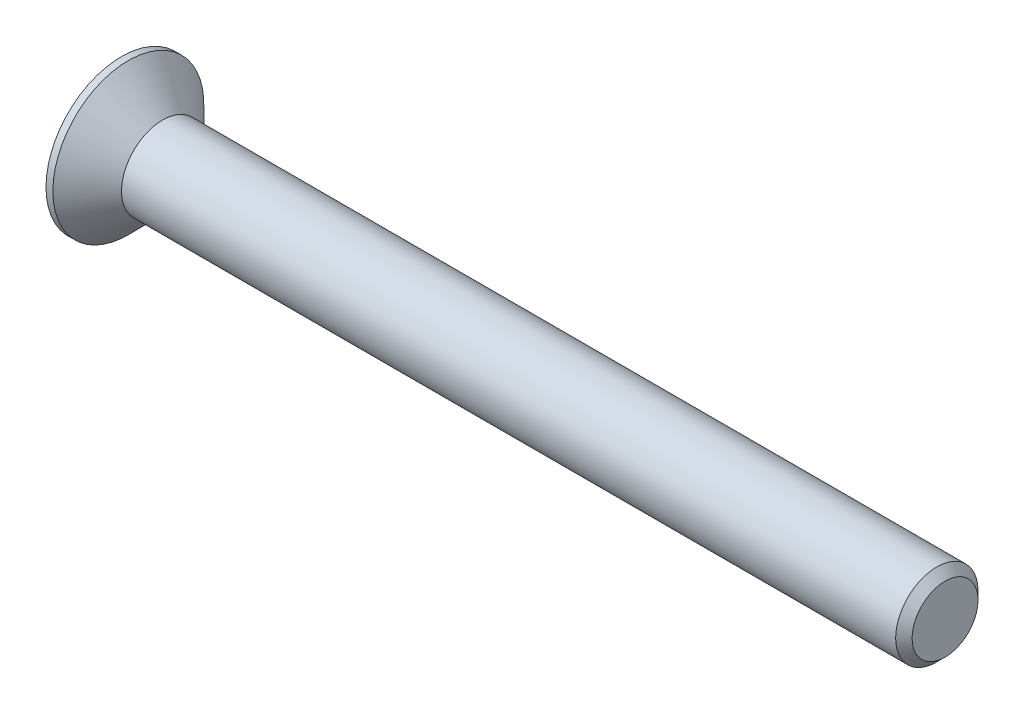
ISO-10303-21;
HEADER;
FILE_DESCRIPTION(('STEP AP214'),'2;1');
FILE_NAME('part.step','',(''),(''),'','','');
FILE_SCHEMA(('AUTOMOTIVE_DESIGN { 1 0 10303 214 1 1 1 1 }'));
ENDSEC;
DATA;
#1=APPLICATION_CONTEXT('core data for automotive mechanical design processes');
#2=APPLICATION_PROTOCOL_DEFINITION('international standard','automotive_design',2000,#1);
#3=PRODUCT_CONTEXT('',#1,'mechanical');
#4=PRODUCT('Part','Part','',(#3));
#5=PRODUCT_RELATED_PRODUCT_CATEGORY('part','',(#4));
#6=PRODUCT_DEFINITION_FORMATION('','',#4);
#7=PRODUCT_DEFINITION_CONTEXT('part definition',#1,'design');
#8=PRODUCT_DEFINITION('design','',#6,#7);
#9=PRODUCT_DEFINITION_SHAPE('','',#8);
#10=(LENGTH_UNIT() NAMED_UNIT(*) SI_UNIT(.MILLI.,.METRE.));
#11=(NAMED_UNIT(*) PLANE_ANGLE_UNIT() SI_UNIT($,.RADIAN.));
#12=(NAMED_UNIT(*) SI_UNIT($,.STERADIAN.) SOLID_ANGLE_UNIT());
#13=UNCERTAINTY_MEASURE_WITH_UNIT(LENGTH_MEASURE(1.E-05),#10,'distance_accuracy_value','');
#14=(GEOMETRIC_REPRESENTATION_CONTEXT(3) GLOBAL_UNCERTAINTY_ASSIGNED_CONTEXT((#13)) GLOBAL_UNIT_ASSIGNED_CONTEXT((#10,
#11,#12)) REPRESENTATION_CONTEXT('',''));
#15=CARTESIAN_POINT('',(0.,0.,0.));
#16=DIRECTION('',(0.,0.,1.));
#17=DIRECTION('',(1.,0.,0.));
#18=AXIS2_PLACEMENT_3D('',#15,#16,#17);
#19=CARTESIAN_POINT('',(0.,0.,0.));
#20=DIRECTION('',(-1.,0.,0.));
#21=DIRECTION('',(0.,0.,1.));
#22=AXIS2_PLACEMENT_3D('',#19,#20,#21);
#23=CONICAL_SURFACE('',#22,3.,0.78539816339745);
#24=CARTESIAN_POINT('',(-2.49999999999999,0.,0.));
#25=DIRECTION('',(-1.,0.,0.));
#26=DIRECTION('',(0.,0.,1.));
#27=AXIS2_PLACEMENT_3D('',#24,#25,#26);
#28=CIRCLE('',#27,5.5);
#29=CARTESIAN_POINT('',(-2.49999999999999,0.,5.5));
#30=VERTEX_POINT('',#29);
#31=EDGE_CURVE('E189',#30,#30,#28,.T.);
#32=ORIENTED_EDGE('',*,*,#31,.F.);
#33=EDGE_LOOP('',(#32));
#34=FACE_BOUND('',#33,.T.);
#35=CARTESIAN_POINT('',(0.,0.,0.));
#36=DIRECTION('',(-1.,0.,0.));
#37=DIRECTION('',(0.,0.,1.));
#38=AXIS2_PLACEMENT_3D('',#35,#36,#37);
#39=CIRCLE('',#38,3.);
#40=CARTESIAN_POINT('',(0.,0.,3.));
#41=VERTEX_POINT('',#40);
#42=EDGE_CURVE('E212',#41,#41,#39,.T.);
#43=ORIENTED_EDGE('',*,*,#42,.T.);
#44=EDGE_LOOP('',(#43));
#45=FACE_BOUND('',#44,.T.);
#46=ADVANCED_FACE('F33',(#34,#45),#23,.T.);
#47=CARTESIAN_POINT('',(-3.,0.,0.));
#48=DIRECTION('',(-1.,0.,0.));
#49=DIRECTION('',(0.,0.,1.));
#50=AXIS2_PLACEMENT_3D('',#47,#48,#49);
#51=CYLINDRICAL_SURFACE('',#50,3.);
#52=CARTESIAN_POINT('',(56.4,0.,0.));
#53=DIRECTION('',(-1.,0.,0.));
#54=DIRECTION('',(0.,0.,1.));
#55=AXIS2_PLACEMENT_3D('',#52,#53,#54);
#56=CIRCLE('',#55,3.);
#57=CARTESIAN_POINT('',(56.4,0.,3.));
#58=VERTEX_POINT('',#57);
#59=EDGE_CURVE('E41',#58,#58,#56,.T.);
#60=ORIENTED_EDGE('',*,*,#59,.T.);
#61=EDGE_LOOP('',(#60));
#62=FACE_BOUND('',#61,.T.);
#63=ORIENTED_EDGE('',*,*,#42,.F.);
#64=EDGE_LOOP('',(#63));
#65=FACE_BOUND('',#64,.T.);
#66=ADVANCED_FACE('F217',(#62,#65),#51,.T.);
#67=CARTESIAN_POINT('',(57.,0.,0.));
#68=DIRECTION('',(-1.,0.,0.));
#69=DIRECTION('',(0.,0.,1.));
#70=AXIS2_PLACEMENT_3D('',#67,#68,#69);
#71=PLANE('',#70);
#72=CARTESIAN_POINT('',(57.,0.,0.));
#73=DIRECTION('',(-1.,0.,0.));
#74=DIRECTION('',(0.,0.,1.));
#75=AXIS2_PLACEMENT_3D('',#72,#73,#74);
#76=CIRCLE('',#75,2.39999999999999);
#77=CARTESIAN_POINT('',(57.,0.,2.39999999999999));
#78=VERTEX_POINT('',#77);
#79=EDGE_CURVE('E11',#78,#78,#76,.F.);
#80=ORIENTED_EDGE('',*,*,#79,.T.);
#81=EDGE_LOOP('',(#80));
#82=FACE_BOUND('',#81,.T.);
#83=ADVANCED_FACE('F239',(#82),#71,.F.);
#84=CARTESIAN_POINT('',(-3.,5.5,0.));
#85=DIRECTION('',(1.,0.,0.));
#86=DIRECTION('',(0.,0.,-1.));
#87=AXIS2_PLACEMENT_3D('',#84,#85,#86);
#88=PLANE('',#87);
#89=DIRECTION('',(0.,0.,-1.));
#90=VECTOR('',#89,1.);
#91=CARTESIAN_POINT('',(-3.,0.825,-3.3));
#92=LINE('',#91,#90);
#93=CARTESIAN_POINT('',(-3.,0.825,-0.825));
#94=VERTEX_POINT('',#93);
#95=CARTESIAN_POINT('',(-3.,0.825,-3.3));
#96=VERTEX_POINT('',#95);
#97=EDGE_CURVE('E158',#94,#96,#92,.T.);
#98=ORIENTED_EDGE('',*,*,#97,.F.);
#99=DIRECTION('',(0.,-1.,0.));
#100=VECTOR('',#99,1.);
#101=CARTESIAN_POINT('',(-3.,0.825,-0.825));
#102=LINE('',#101,#100);
#103=CARTESIAN_POINT('',(-3.,3.3,-0.825));
#104=VERTEX_POINT('',#103);
#105=EDGE_CURVE('E48',#104,#94,#102,.T.);
#106=ORIENTED_EDGE('',*,*,#105,.F.);
#107=DIRECTION('',(0.,0.,-1.));
#108=VECTOR('',#107,1.);
#109=CARTESIAN_POINT('',(-3.,3.3,-0.825));
#110=LINE('',#109,#108);
#111=CARTESIAN_POINT('',(-3.,3.3,0.825));
#112=VERTEX_POINT('',#111);
#113=EDGE_CURVE('E185',#112,#104,#110,.T.);
#114=ORIENTED_EDGE('',*,*,#113,.F.);
#115=DIRECTION('',(0.,1.,0.));
#116=VECTOR('',#115,1.);
#117=CARTESIAN_POINT('',(-3.,3.3,0.825));
#118=LINE('',#117,#116);
#119=CARTESIAN_POINT('',(-3.,0.825,0.825));
#120=VERTEX_POINT('',#119);
#121=EDGE_CURVE('E183',#120,#112,#118,.T.);
#122=ORIENTED_EDGE('',*,*,#121,.F.);
#123=DIRECTION('',(0.,0.,-1.));
#124=VECTOR('',#123,1.);
#125=CARTESIAN_POINT('',(-3.,0.825,0.825));
#126=LINE('',#125,#124);
#127=CARTESIAN_POINT('',(-3.,0.825,3.3));
#128=VERTEX_POINT('',#127);
#129=EDGE_CURVE('E132',#128,#120,#126,.T.);
#130=ORIENTED_EDGE('',*,*,#129,.F.);
#131=DIRECTION('',(0.,1.,0.));
#132=VECTOR('',#131,1.);
#133=CARTESIAN_POINT('',(-3.,0.825,3.3));
#134=LINE('',#133,#132);
#135=CARTESIAN_POINT('',(-3.,-0.825,3.3));
#136=VERTEX_POINT('',#135);
#137=EDGE_CURVE('E179',#136,#128,#134,.T.);
#138=ORIENTED_EDGE('',*,*,#137,.F.);
#139=DIRECTION('',(0.,0.,1.));
#140=VECTOR('',#139,1.);
#141=CARTESIAN_POINT('',(-3.,-0.825,3.3));
#142=LINE('',#141,#140);
#143=CARTESIAN_POINT('',(-3.,-0.825,0.825));
#144=VERTEX_POINT('',#143);
#145=EDGE_CURVE('E176',#144,#136,#142,.T.);
#146=ORIENTED_EDGE('',*,*,#145,.F.);
#147=DIRECTION('',(0.,1.,0.));
#148=VECTOR('',#147,1.);
#149=CARTESIAN_POINT('',(-3.,-0.825,0.825));
#150=LINE('',#149,#148);
#151=CARTESIAN_POINT('',(-3.,-3.3,0.825));
#152=VERTEX_POINT('',#151);
#153=EDGE_CURVE('E173',#152,#144,#150,.T.);
#154=ORIENTED_EDGE('',*,*,#153,.F.);
#155=DIRECTION('',(0.,0.,1.));
#156=VECTOR('',#155,1.);
#157=CARTESIAN_POINT('',(-3.,-3.3,0.825));
#158=LINE('',#157,#156);
#159=CARTESIAN_POINT('',(-3.,-3.3,-0.825));
#160=VERTEX_POINT('',#159);
#161=EDGE_CURVE('E170',#160,#152,#158,.T.);
#162=ORIENTED_EDGE('',*,*,#161,.F.);
#163=DIRECTION('',(0.,-1.,0.));
#164=VECTOR('',#163,1.);
#165=CARTESIAN_POINT('',(-3.,-3.3,-0.825));
#166=LINE('',#165,#164);
#167=CARTESIAN_POINT('',(-3.,-0.825,-0.825));
#168=VERTEX_POINT('',#167);
#169=EDGE_CURVE('E167',#168,#160,#166,.T.);
#170=ORIENTED_EDGE('',*,*,#169,.F.);
#171=DIRECTION('',(0.,0.,1.));
#172=VECTOR('',#171,1.);
#173=CARTESIAN_POINT('',(-3.,-0.825,-0.825));
#174=LINE('',#173,#172);
#175=CARTESIAN_POINT('',(-3.,-0.825,-3.3));
#176=VERTEX_POINT('',#175);
#177=EDGE_CURVE('E164',#176,#168,#174,.T.);
#178=ORIENTED_EDGE('',*,*,#177,.F.);
#179=DIRECTION('',(0.,-1.,0.));
#180=VECTOR('',#179,1.);
#181=CARTESIAN_POINT('',(-3.,-0.825,-3.3));
#182=LINE('',#181,#180);
#183=EDGE_CURVE('E161',#96,#176,#182,.T.);
#184=ORIENTED_EDGE('',*,*,#183,.F.);
#185=EDGE_LOOP('',(#98,#106,#114,#122,#130,#138,#146,#154,#162,#170,#178,#184));
#186=FACE_BOUND('',#185,.T.);
#187=CARTESIAN_POINT('',(-3.,0.,0.));
#188=DIRECTION('',(-1.,0.,0.));
#189=DIRECTION('',(0.,0.,1.));
#190=AXIS2_PLACEMENT_3D('',#187,#188,#189);
#191=CIRCLE('',#190,5.5);
#192=CARTESIAN_POINT('',(-3.,0.,5.5));
#193=VERTEX_POINT('',#192);
#194=EDGE_CURVE('E209',#193,#193,#191,.T.);
#195=ORIENTED_EDGE('',*,*,#194,.T.);
#196=EDGE_LOOP('',(#195));
#197=FACE_BOUND('',#196,.T.);
#198=ADVANCED_FACE('F230',(#186,#197),#88,.F.);
#199=CARTESIAN_POINT('',(-3.,0.,0.));
#200=DIRECTION('',(-1.,0.,0.));
#201=DIRECTION('',(0.,0.,1.));
#202=AXIS2_PLACEMENT_3D('',#199,#200,#201);
#203=CYLINDRICAL_SURFACE('',#202,5.5);
#204=ORIENTED_EDGE('',*,*,#194,.F.);
#205=EDGE_LOOP('',(#204));
#206=FACE_BOUND('',#205,.T.);
#207=ORIENTED_EDGE('',*,*,#31,.T.);
#208=EDGE_LOOP('',(#207));
#209=FACE_BOUND('',#208,.T.);
#210=ADVANCED_FACE('F222',(#206,#209),#203,.T.);
#211=CARTESIAN_POINT('',(56.4,0.,0.));
#212=DIRECTION('',(-1.,0.,0.));
#213=DIRECTION('',(0.,0.,1.));
#214=AXIS2_PLACEMENT_3D('',#211,#212,#213);
#215=CONICAL_SURFACE('',#214,3.,0.785398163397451);
#216=ORIENTED_EDGE('',*,*,#79,.F.);
#217=EDGE_LOOP('',(#216));
#218=FACE_BOUND('',#217,.T.);
#219=ORIENTED_EDGE('',*,*,#59,.F.);
#220=EDGE_LOOP('',(#219));
#221=FACE_BOUND('',#220,.T.);
#222=ADVANCED_FACE('F35',(#218,#221),#215,.T.);
#223=CARTESIAN_POINT('',(-0.5,0.825,-0.825));
#224=DIRECTION('',(0.,0.,-1.));
#225=DIRECTION('',(-1.,0.,0.));
#226=AXIS2_PLACEMENT_3D('',#223,#224,#225);
#227=PLANE('',#226);
#228=ORIENTED_EDGE('',*,*,#105,.T.);
#229=DIRECTION('',(-1.,0.,0.));
#230=VECTOR('',#229,1.);
#231=CARTESIAN_POINT('',(-0.5,0.825,-0.825));
#232=LINE('',#231,#230);
#233=CARTESIAN_POINT('',(-0.5,0.825,-0.825));
#234=VERTEX_POINT('',#233);
#235=EDGE_CURVE('E96',#234,#94,#232,.T.);
#236=ORIENTED_EDGE('',*,*,#235,.F.);
#237=DIRECTION('',(0.,-1.,0.));
#238=VECTOR('',#237,1.);
#239=CARTESIAN_POINT('',(-0.5,0.825,-0.825));
#240=LINE('',#239,#238);
#241=CARTESIAN_POINT('',(-0.5,3.3,-0.825));
#242=VERTEX_POINT('',#241);
#243=EDGE_CURVE('E187',#242,#234,#240,.T.);
#244=ORIENTED_EDGE('',*,*,#243,.F.);
#245=DIRECTION('',(-1.,0.,0.));
#246=VECTOR('',#245,1.);
#247=CARTESIAN_POINT('',(-0.5,3.3,-0.825));
#248=LINE('',#247,#246);
#249=EDGE_CURVE('E56',#242,#104,#248,.T.);
#250=ORIENTED_EDGE('',*,*,#249,.T.);
#251=EDGE_LOOP('',(#228,#236,#244,#250));
#252=FACE_BOUND('',#251,.T.);
#253=ADVANCED_FACE('F221',(#252),#227,.F.);
#254=CARTESIAN_POINT('',(-0.5,3.3,-0.825));
#255=DIRECTION('',(0.,1.,0.));
#256=DIRECTION('',(-1.,0.,0.));
#257=AXIS2_PLACEMENT_3D('',#254,#255,#256);
#258=PLANE('',#257);
#259=ORIENTED_EDGE('',*,*,#113,.T.);
#260=ORIENTED_EDGE('',*,*,#249,.F.);
#261=DIRECTION('',(0.,0.,-1.));
#262=VECTOR('',#261,1.);
#263=CARTESIAN_POINT('',(-0.5,3.3,-0.825));
#264=LINE('',#263,#262);
#265=CARTESIAN_POINT('',(-0.5,3.3,0.825));
#266=VERTEX_POINT('',#265);
#267=EDGE_CURVE('E144',#266,#242,#264,.T.);
#268=ORIENTED_EDGE('',*,*,#267,.F.);
#269=DIRECTION('',(-1.,0.,0.));
#270=VECTOR('',#269,1.);
#271=CARTESIAN_POINT('',(-0.5,3.3,0.825));
#272=LINE('',#271,#270);
#273=EDGE_CURVE('E136',#266,#112,#272,.T.);
#274=ORIENTED_EDGE('',*,*,#273,.T.);
#275=EDGE_LOOP('',(#259,#260,#268,#274));
#276=FACE_BOUND('',#275,.T.);
#277=ADVANCED_FACE('F228',(#276),#258,.F.);
#278=CARTESIAN_POINT('',(-0.5,3.3,0.825));
#279=DIRECTION('',(0.,0.,1.));
#280=DIRECTION('',(1.,0.,0.));
#281=AXIS2_PLACEMENT_3D('',#278,#279,#280);
#282=PLANE('',#281);
#283=ORIENTED_EDGE('',*,*,#121,.T.);
#284=ORIENTED_EDGE('',*,*,#273,.F.);
#285=DIRECTION('',(0.,1.,0.));
#286=VECTOR('',#285,1.);
#287=CARTESIAN_POINT('',(-0.5,3.3,0.825));
#288=LINE('',#287,#286);
#289=CARTESIAN_POINT('',(-0.5,0.825,0.825));
#290=VERTEX_POINT('',#289);
#291=EDGE_CURVE('E140',#290,#266,#288,.T.);
#292=ORIENTED_EDGE('',*,*,#291,.F.);
#293=DIRECTION('',(-1.,0.,0.));
#294=VECTOR('',#293,1.);
#295=CARTESIAN_POINT('',(-0.5,0.825,0.825));
#296=LINE('',#295,#294);
#297=EDGE_CURVE('E125',#290,#120,#296,.T.);
#298=ORIENTED_EDGE('',*,*,#297,.T.);
#299=EDGE_LOOP('',(#283,#284,#292,#298));
#300=FACE_BOUND('',#299,.T.);
#301=ADVANCED_FACE('F141',(#300),#282,.F.);
#302=CARTESIAN_POINT('',(-0.5,0.825,0.825));
#303=DIRECTION('',(0.,1.,0.));
#304=DIRECTION('',(-1.,0.,0.));
#305=AXIS2_PLACEMENT_3D('',#302,#303,#304);
#306=PLANE('',#305);
#307=ORIENTED_EDGE('',*,*,#129,.T.);
#308=ORIENTED_EDGE('',*,*,#297,.F.);
#309=DIRECTION('',(0.,0.,-1.));
#310=VECTOR('',#309,1.);
#311=CARTESIAN_POINT('',(-0.5,0.825,0.825));
#312=LINE('',#311,#310);
#313=CARTESIAN_POINT('',(-0.5,0.825,3.3));
#314=VERTEX_POINT('',#313);
#315=EDGE_CURVE('E129',#314,#290,#312,.T.);
#316=ORIENTED_EDGE('',*,*,#315,.F.);
#317=DIRECTION('',(-1.,0.,0.));
#318=VECTOR('',#317,1.);
#319=CARTESIAN_POINT('',(-0.5,0.825,3.3));
#320=LINE('',#319,#318);
#321=EDGE_CURVE('E137',#314,#128,#320,.T.);
#322=ORIENTED_EDGE('',*,*,#321,.T.);
#323=EDGE_LOOP('',(#307,#308,#316,#322));
#324=FACE_BOUND('',#323,.T.);
#325=ADVANCED_FACE('F127',(#324),#306,.F.);
#326=CARTESIAN_POINT('',(-0.5,0.825,3.3));
#327=DIRECTION('',(0.,0.,1.));
#328=DIRECTION('',(1.,0.,0.));
#329=AXIS2_PLACEMENT_3D('',#326,#327,#328);
#330=PLANE('',#329);
#331=ORIENTED_EDGE('',*,*,#137,.T.);
#332=ORIENTED_EDGE('',*,*,#321,.F.);
#333=DIRECTION('',(0.,1.,0.));
#334=VECTOR('',#333,1.);
#335=CARTESIAN_POINT('',(-0.5,0.825,3.3));
#336=LINE('',#335,#334);
#337=CARTESIAN_POINT('',(-0.5,-0.825,3.3));
#338=VERTEX_POINT('',#337);
#339=EDGE_CURVE('E150',#338,#314,#336,.T.);
#340=ORIENTED_EDGE('',*,*,#339,.F.);
#341=DIRECTION('',(-1.,0.,0.));
#342=VECTOR('',#341,1.);
#343=CARTESIAN_POINT('',(-0.5,-0.825,3.3));
#344=LINE('',#343,#342);
#345=EDGE_CURVE('E192',#338,#136,#344,.T.);
#346=ORIENTED_EDGE('',*,*,#345,.T.);
#347=EDGE_LOOP('',(#331,#332,#340,#346));
#348=FACE_BOUND('',#347,.T.);
#349=ADVANCED_FACE('F277',(#348),#330,.F.);
#350=CARTESIAN_POINT('',(-0.5,-0.825,3.3));
#351=DIRECTION('',(0.,-1.,0.));
#352=DIRECTION('',(1.,0.,0.));
#353=AXIS2_PLACEMENT_3D('',#350,#351,#352);
#354=PLANE('',#353);
#355=ORIENTED_EDGE('',*,*,#145,.T.);
#356=ORIENTED_EDGE('',*,*,#345,.F.);
#357=DIRECTION('',(0.,0.,1.));
#358=VECTOR('',#357,1.);
#359=CARTESIAN_POINT('',(-0.5,-0.825,3.3));
#360=LINE('',#359,#358);
#361=CARTESIAN_POINT('',(-0.5,-0.825,0.825));
#362=VERTEX_POINT('',#361);
#363=EDGE_CURVE('E152',#362,#338,#360,.T.);
#364=ORIENTED_EDGE('',*,*,#363,.F.);
#365=DIRECTION('',(-1.,0.,0.));
#366=VECTOR('',#365,1.);
#367=CARTESIAN_POINT('',(-0.5,-0.825,0.825));
#368=LINE('',#367,#366);
#369=EDGE_CURVE('E194',#362,#144,#368,.T.);
#370=ORIENTED_EDGE('',*,*,#369,.T.);
#371=EDGE_LOOP('',(#355,#356,#364,#370));
#372=FACE_BOUND('',#371,.T.);
#373=ADVANCED_FACE('F273',(#372),#354,.F.);
#374=CARTESIAN_POINT('',(-0.5,-0.825,0.825));
#375=DIRECTION('',(0.,0.,1.));
#376=DIRECTION('',(1.,0.,0.));
#377=AXIS2_PLACEMENT_3D('',#374,#375,#376);
#378=PLANE('',#377);
#379=ORIENTED_EDGE('',*,*,#153,.T.);
#380=ORIENTED_EDGE('',*,*,#369,.F.);
#381=DIRECTION('',(0.,1.,0.));
#382=VECTOR('',#381,1.);
#383=CARTESIAN_POINT('',(-0.5,-0.825,0.825));
#384=LINE('',#383,#382);
#385=CARTESIAN_POINT('',(-0.5,-3.3,0.825));
#386=VERTEX_POINT('',#385);
#387=EDGE_CURVE('E422',#386,#362,#384,.T.);
#388=ORIENTED_EDGE('',*,*,#387,.F.);
#389=DIRECTION('',(-1.,0.,0.));
#390=VECTOR('',#389,1.);
#391=CARTESIAN_POINT('',(-0.5,-3.3,0.825));
#392=LINE('',#391,#390);
#393=EDGE_CURVE('E196',#386,#152,#392,.T.);
#394=ORIENTED_EDGE('',*,*,#393,.T.);
#395=EDGE_LOOP('',(#379,#380,#388,#394));
#396=FACE_BOUND('',#395,.T.);
#397=ADVANCED_FACE('F269',(#396),#378,.F.);
#398=CARTESIAN_POINT('',(-0.5,-3.3,0.825));
#399=DIRECTION('',(0.,-1.,0.));
#400=DIRECTION('',(1.,0.,0.));
#401=AXIS2_PLACEMENT_3D('',#398,#399,#400);
#402=PLANE('',#401);
#403=ORIENTED_EDGE('',*,*,#161,.T.);
#404=ORIENTED_EDGE('',*,*,#393,.F.);
#405=DIRECTION('',(0.,0.,1.));
#406=VECTOR('',#405,1.);
#407=CARTESIAN_POINT('',(-0.5,-3.3,0.825));
#408=LINE('',#407,#406);
#409=CARTESIAN_POINT('',(-0.5,-3.3,-0.825));
#410=VERTEX_POINT('',#409);
#411=EDGE_CURVE('E419',#410,#386,#408,.T.);
#412=ORIENTED_EDGE('',*,*,#411,.F.);
#413=DIRECTION('',(-1.,0.,0.));
#414=VECTOR('',#413,1.);
#415=CARTESIAN_POINT('',(-0.5,-3.3,-0.825));
#416=LINE('',#415,#414);
#417=EDGE_CURVE('E198',#410,#160,#416,.T.);
#418=ORIENTED_EDGE('',*,*,#417,.T.);
#419=EDGE_LOOP('',(#403,#404,#412,#418));
#420=FACE_BOUND('',#419,.T.);
#421=ADVANCED_FACE('F265',(#420),#402,.F.);
#422=CARTESIAN_POINT('',(-0.5,-3.3,-0.825));
#423=DIRECTION('',(0.,0.,-1.));
#424=DIRECTION('',(-1.,0.,0.));
#425=AXIS2_PLACEMENT_3D('',#422,#423,#424);
#426=PLANE('',#425);
#427=ORIENTED_EDGE('',*,*,#169,.T.);
#428=ORIENTED_EDGE('',*,*,#417,.F.);
#429=DIRECTION('',(0.,-1.,0.));
#430=VECTOR('',#429,1.);
#431=CARTESIAN_POINT('',(-0.5,-3.3,-0.825));
#432=LINE('',#431,#430);
#433=CARTESIAN_POINT('',(-0.5,-0.825,-0.825));
#434=VERTEX_POINT('',#433);
#435=EDGE_CURVE('E416',#434,#410,#432,.T.);
#436=ORIENTED_EDGE('',*,*,#435,.F.);
#437=DIRECTION('',(-1.,0.,0.));
#438=VECTOR('',#437,1.);
#439=CARTESIAN_POINT('',(-0.5,-0.825,-0.825));
#440=LINE('',#439,#438);
#441=EDGE_CURVE('E200',#434,#168,#440,.T.);
#442=ORIENTED_EDGE('',*,*,#441,.T.);
#443=EDGE_LOOP('',(#427,#428,#436,#442));
#444=FACE_BOUND('',#443,.T.);
#445=ADVANCED_FACE('F261',(#444),#426,.F.);
#446=CARTESIAN_POINT('',(-0.5,-0.825,-0.825));
#447=DIRECTION('',(0.,-1.,0.));
#448=DIRECTION('',(1.,0.,0.));
#449=AXIS2_PLACEMENT_3D('',#446,#447,#448);
#450=PLANE('',#449);
#451=ORIENTED_EDGE('',*,*,#177,.T.);
#452=ORIENTED_EDGE('',*,*,#441,.F.);
#453=DIRECTION('',(0.,0.,1.));
#454=VECTOR('',#453,1.);
#455=CARTESIAN_POINT('',(-0.5,-0.825,-0.825));
#456=LINE('',#455,#454);
#457=CARTESIAN_POINT('',(-0.5,-0.825,-3.3));
#458=VERTEX_POINT('',#457);
#459=EDGE_CURVE('E413',#458,#434,#456,.T.);
#460=ORIENTED_EDGE('',*,*,#459,.F.);
#461=DIRECTION('',(-1.,0.,0.));
#462=VECTOR('',#461,1.);
#463=CARTESIAN_POINT('',(-0.5,-0.825,-3.3));
#464=LINE('',#463,#462);
#465=EDGE_CURVE('E202',#458,#176,#464,.T.);
#466=ORIENTED_EDGE('',*,*,#465,.T.);
#467=EDGE_LOOP('',(#451,#452,#460,#466));
#468=FACE_BOUND('',#467,.T.);
#469=ADVANCED_FACE('F257',(#468),#450,.F.);
#470=CARTESIAN_POINT('',(-0.5,-0.825,-3.3));
#471=DIRECTION('',(0.,0.,-1.));
#472=DIRECTION('',(-1.,0.,0.));
#473=AXIS2_PLACEMENT_3D('',#470,#471,#472);
#474=PLANE('',#473);
#475=ORIENTED_EDGE('',*,*,#183,.T.);
#476=ORIENTED_EDGE('',*,*,#465,.F.);
#477=DIRECTION('',(0.,-1.,0.));
#478=VECTOR('',#477,1.);
#479=CARTESIAN_POINT('',(-0.5,-0.825,-3.3));
#480=LINE('',#479,#478);
#481=CARTESIAN_POINT('',(-0.5,0.825,-3.3));
#482=VERTEX_POINT('',#481);
#483=EDGE_CURVE('E408',#482,#458,#480,.T.);
#484=ORIENTED_EDGE('',*,*,#483,.F.);
#485=DIRECTION('',(-1.,0.,0.));
#486=VECTOR('',#485,1.);
#487=CARTESIAN_POINT('',(-0.5,0.825,-3.3));
#488=LINE('',#487,#486);
#489=EDGE_CURVE('E204',#482,#96,#488,.T.);
#490=ORIENTED_EDGE('',*,*,#489,.T.);
#491=EDGE_LOOP('',(#475,#476,#484,#490));
#492=FACE_BOUND('',#491,.T.);
#493=ADVANCED_FACE('F253',(#492),#474,.F.);
#494=CARTESIAN_POINT('',(-0.5,0.825,-3.3));
#495=DIRECTION('',(0.,1.,0.));
#496=DIRECTION('',(-1.,0.,0.));
#497=AXIS2_PLACEMENT_3D('',#494,#495,#496);
#498=PLANE('',#497);
#499=ORIENTED_EDGE('',*,*,#97,.T.);
#500=ORIENTED_EDGE('',*,*,#489,.F.);
#501=DIRECTION('',(0.,0.,-1.));
#502=VECTOR('',#501,1.);
#503=CARTESIAN_POINT('',(-0.5,0.825,-3.3));
#504=LINE('',#503,#502);
#505=EDGE_CURVE('E406',#234,#482,#504,.T.);
#506=ORIENTED_EDGE('',*,*,#505,.F.);
#507=ORIENTED_EDGE('',*,*,#235,.T.);
#508=EDGE_LOOP('',(#499,#500,#506,#507));
#509=FACE_BOUND('',#508,.T.);
#510=ADVANCED_FACE('F250',(#509),#498,.F.);
#511=CARTESIAN_POINT('',(-0.5,0.,0.));
#512=DIRECTION('',(1.,0.,0.));
#513=DIRECTION('',(0.,0.,-1.));
#514=AXIS2_PLACEMENT_3D('',#511,#512,#513);
#515=PLANE('',#514);
#516=ORIENTED_EDGE('',*,*,#243,.T.);
#517=ORIENTED_EDGE('',*,*,#505,.T.);
#518=ORIENTED_EDGE('',*,*,#483,.T.);
#519=ORIENTED_EDGE('',*,*,#459,.T.);
#520=ORIENTED_EDGE('',*,*,#435,.T.);
#521=ORIENTED_EDGE('',*,*,#411,.T.);
#522=ORIENTED_EDGE('',*,*,#387,.T.);
#523=ORIENTED_EDGE('',*,*,#363,.T.);
#524=ORIENTED_EDGE('',*,*,#339,.T.);
#525=ORIENTED_EDGE('',*,*,#315,.T.);
#526=ORIENTED_EDGE('',*,*,#291,.T.);
#527=ORIENTED_EDGE('',*,*,#267,.T.);
#528=EDGE_LOOP('',(#516,#517,#518,#519,#520,#521,#522,#523,#524,#525,#526,#527));
#529=FACE_BOUND('',#528,.T.);
#530=ADVANCED_FACE('F147',(#529),#515,.F.);
#531=CLOSED_SHELL('',(#46,#66,#83,#198,#210,#222,#253,#277,#301,#325,#349,#373,#397,#421,#445,
#469,#493,#510,#530));
#532=MANIFOLD_SOLID_BREP('B2',#531);
#533=ADVANCED_BREP_SHAPE_REPRESENTATION('',(#18,#532),#14);
#534=SHAPE_DEFINITION_REPRESENTATION(#9,#533);
ENDSEC;
END-ISO-10303-21;
